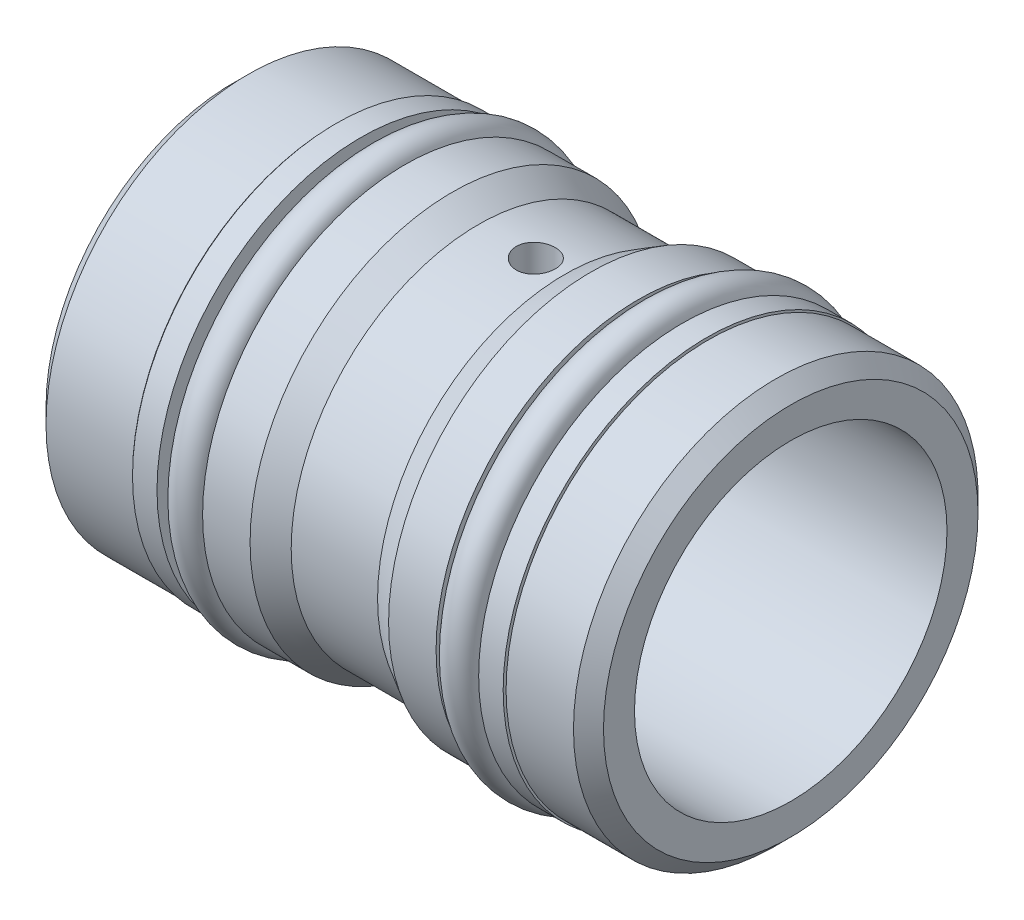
ISO-10303-21;
HEADER;
FILE_DESCRIPTION(('STEP AP214'),'2;1');
FILE_NAME('part.step','',(''),(''),'','','');
FILE_SCHEMA(('AUTOMOTIVE_DESIGN { 1 0 10303 214 1 1 1 1 }'));
ENDSEC;
DATA;
#1=APPLICATION_CONTEXT('core data for automotive mechanical design processes');
#2=APPLICATION_PROTOCOL_DEFINITION('international standard','automotive_design',2000,#1);
#3=PRODUCT_CONTEXT('',#1,'mechanical');
#4=PRODUCT('Part','Part','',(#3));
#5=PRODUCT_RELATED_PRODUCT_CATEGORY('part','',(#4));
#6=PRODUCT_DEFINITION_FORMATION('','',#4);
#7=PRODUCT_DEFINITION_CONTEXT('part definition',#1,'design');
#8=PRODUCT_DEFINITION('design','',#6,#7);
#9=PRODUCT_DEFINITION_SHAPE('','',#8);
#10=(LENGTH_UNIT() NAMED_UNIT(*) SI_UNIT(.MILLI.,.METRE.));
#11=(NAMED_UNIT(*) PLANE_ANGLE_UNIT() SI_UNIT($,.RADIAN.));
#12=(NAMED_UNIT(*) SI_UNIT($,.STERADIAN.) SOLID_ANGLE_UNIT());
#13=UNCERTAINTY_MEASURE_WITH_UNIT(LENGTH_MEASURE(1.E-05),#10,'distance_accuracy_value','');
#14=(GEOMETRIC_REPRESENTATION_CONTEXT(3) GLOBAL_UNCERTAINTY_ASSIGNED_CONTEXT((#13)) GLOBAL_UNIT_ASSIGNED_CONTEXT((#10,
#11,#12)) REPRESENTATION_CONTEXT('',''));
#15=CARTESIAN_POINT('',(0.,0.,0.));
#16=DIRECTION('',(0.,0.,1.));
#17=DIRECTION('',(1.,0.,0.));
#18=AXIS2_PLACEMENT_3D('',#15,#16,#17);
#19=CARTESIAN_POINT('',(0.,0.,0.));
#20=DIRECTION('',(-1.,0.,0.));
#21=DIRECTION('',(0.,0.,1.));
#22=AXIS2_PLACEMENT_3D('',#19,#20,#21);
#23=CYLINDRICAL_SURFACE('',#22,9.51);
#24=CARTESIAN_POINT('',(-1.70719356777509,0.,0.));
#25=DIRECTION('',(-1.,0.,0.));
#26=DIRECTION('',(0.,0.,1.));
#27=AXIS2_PLACEMENT_3D('',#24,#25,#26);
#28=CIRCLE('',#27,9.51);
#29=CARTESIAN_POINT('',(-1.70719356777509,0.,9.51));
#30=VERTEX_POINT('',#29);
#31=EDGE_CURVE('E37',#30,#30,#28,.T.);
#32=ORIENTED_EDGE('',*,*,#31,.F.);
#33=EDGE_LOOP('',(#32));
#34=FACE_BOUND('',#33,.T.);
#35=CARTESIAN_POINT('',(1.21,-9.45826684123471,0.9906));
#36=CARTESIAN_POINT('',(1.26548025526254,-9.45826751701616,0.990597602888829));
#37=CARTESIAN_POINT('',(1.32099689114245,-9.45876025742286,0.985923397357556));
#38=CARTESIAN_POINT('',(1.43049006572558,-9.46067763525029,0.967348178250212));
#39=CARTESIAN_POINT('',(1.48446485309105,-9.46210329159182,0.953437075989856));
#40=CARTESIAN_POINT('',(1.58927290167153,-9.46572330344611,0.916798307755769));
#41=CARTESIAN_POINT('',(1.64010807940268,-9.46791718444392,0.894076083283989));
#42=CARTESIAN_POINT('',(1.73723242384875,-9.47282586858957,0.840470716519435));
#43=CARTESIAN_POINT('',(1.78352247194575,-9.4755405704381,0.809589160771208));
#44=CARTESIAN_POINT('',(1.8704353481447,-9.48119697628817,0.740411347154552));
#45=CARTESIAN_POINT('',(1.91103777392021,-9.48413944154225,0.702089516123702));
#46=CARTESIAN_POINT('',(1.98524707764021,-9.48991293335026,0.619173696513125));
#47=CARTESIAN_POINT('',(2.01885363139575,-9.49274395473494,0.574579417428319));
#48=CARTESIAN_POINT('',(2.07818821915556,-9.49798314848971,0.480258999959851));
#49=CARTESIAN_POINT('',(2.10389812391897,-9.50039034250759,0.430521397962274));
#50=CARTESIAN_POINT('',(2.14659360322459,-9.50450235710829,0.327405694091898));
#51=CARTESIAN_POINT('',(2.16357940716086,-9.5062071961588,0.274027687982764));
#52=CARTESIAN_POINT('',(2.18828448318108,-9.50871706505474,0.165353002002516));
#53=CARTESIAN_POINT('',(2.19603734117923,-9.50952535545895,0.110064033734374));
#54=CARTESIAN_POINT('',(2.20216039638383,-9.51016215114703,-0.0010358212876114));
#55=CARTESIAN_POINT('',(2.20053085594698,-9.50999068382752,-0.0568466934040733));
#56=CARTESIAN_POINT('',(2.18796258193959,-9.50868994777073,-0.167178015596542));
#57=CARTESIAN_POINT('',(2.17705996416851,-9.50756439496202,-0.221702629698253));
#58=CARTESIAN_POINT('',(2.14631131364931,-9.5044862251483,-0.328143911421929));
#59=CARTESIAN_POINT('',(2.12646515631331,-9.50253359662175,-0.380060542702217));
#60=CARTESIAN_POINT('',(2.07835336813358,-9.49801438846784,-0.479925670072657));
#61=CARTESIAN_POINT('',(2.05007180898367,-9.49544664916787,-0.527866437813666));
#62=CARTESIAN_POINT('',(1.98590359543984,-9.48998521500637,-0.618334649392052));
#63=CARTESIAN_POINT('',(1.95001669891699,-9.48709150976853,-0.660861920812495));
#64=CARTESIAN_POINT('',(1.87145351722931,-9.48128652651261,-0.739507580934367));
#65=CARTESIAN_POINT('',(1.82874580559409,-9.47837523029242,-0.775594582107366));
#66=CARTESIAN_POINT('',(1.73786211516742,-9.4728768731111,-0.840092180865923));
#67=CARTESIAN_POINT('',(1.68968612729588,-9.47028981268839,-0.868502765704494));
#68=CARTESIAN_POINT('',(1.58920872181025,-9.4657326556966,-0.916841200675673));
#69=CARTESIAN_POINT('',(1.53690632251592,-9.46376270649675,-0.936767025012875));
#70=CARTESIAN_POINT('',(1.42967308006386,-9.46066583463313,-0.967545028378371));
#71=CARTESIAN_POINT('',(1.37474232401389,-9.45953888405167,-0.9783975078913));
#72=CARTESIAN_POINT('',(1.264087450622,-9.4582604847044,-0.990680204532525));
#73=CARTESIAN_POINT('',(1.20836826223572,-9.45810448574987,-0.992154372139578));
#74=CARTESIAN_POINT('',(1.0974761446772,-9.45877364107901,-0.985754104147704));
#75=CARTESIAN_POINT('',(1.04230320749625,-9.45959878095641,-0.977879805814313));
#76=CARTESIAN_POINT('',(0.934198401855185,-9.46213310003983,-0.953042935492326));
#77=CARTESIAN_POINT('',(0.881261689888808,-9.46384025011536,-0.936101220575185));
#78=CARTESIAN_POINT('',(0.778981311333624,-9.46794459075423,-0.893631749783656));
#79=CARTESIAN_POINT('',(0.729637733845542,-9.47034179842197,-0.868103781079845));
#80=CARTESIAN_POINT('',(0.635744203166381,-9.47556714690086,-0.809076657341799));
#81=CARTESIAN_POINT('',(0.591212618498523,-9.47839684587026,-0.775548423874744));
#82=CARTESIAN_POINT('',(0.508393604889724,-9.48416327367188,-0.701514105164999));
#83=CARTESIAN_POINT('',(0.470106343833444,-9.4871000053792,-0.661007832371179));
#84=CARTESIAN_POINT('',(0.400710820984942,-9.49276337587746,-0.573976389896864));
#85=CARTESIAN_POINT('',(0.36963126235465,-9.49548914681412,-0.527428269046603));
#86=CARTESIAN_POINT('',(0.31573105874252,-9.5004107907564,-0.429747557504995));
#87=CARTESIAN_POINT('',(0.292910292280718,-9.50260667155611,-0.3786150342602));
#88=CARTESIAN_POINT('',(0.256223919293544,-9.50621721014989,-0.273316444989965));
#89=CARTESIAN_POINT('',(0.242341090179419,-9.50763336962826,-0.219156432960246));
#90=CARTESIAN_POINT('',(0.223868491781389,-9.50953107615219,-0.109258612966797));
#91=CARTESIAN_POINT('',(0.219278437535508,-9.51001265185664,-0.0535208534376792));
#92=CARTESIAN_POINT('',(0.21952588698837,-9.50998689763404,0.0576685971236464));
#93=CARTESIAN_POINT('',(0.224318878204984,-9.5094842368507,0.113120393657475));
#94=CARTESIAN_POINT('',(0.243102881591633,-9.50755571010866,0.222426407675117));
#95=CARTESIAN_POINT('',(0.257093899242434,-9.50612984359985,0.276280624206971));
#96=CARTESIAN_POINT('',(0.293864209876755,-9.50251461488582,0.380861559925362));
#97=CARTESIAN_POINT('',(0.316642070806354,-9.50032537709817,0.431588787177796));
#98=CARTESIAN_POINT('',(0.370334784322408,-9.49542719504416,0.528507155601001));
#99=CARTESIAN_POINT('',(0.401249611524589,-9.49271825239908,0.574698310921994));
#100=CARTESIAN_POINT('',(0.470505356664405,-9.48706860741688,0.661461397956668));
#101=CARTESIAN_POINT('',(0.508879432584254,-9.48412690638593,0.702006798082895));
#102=CARTESIAN_POINT('',(0.591898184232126,-9.47835168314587,0.776102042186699));
#103=CARTESIAN_POINT('',(0.636544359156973,-9.47551818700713,0.809650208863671));
#104=CARTESIAN_POINT('',(0.730974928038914,-9.47027190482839,0.868872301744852));
#105=CARTESIAN_POINT('',(0.780773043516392,-9.46786029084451,0.894524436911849));
#106=CARTESIAN_POINT('',(0.883963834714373,-9.46374473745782,0.937068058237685));
#107=CARTESIAN_POINT('',(0.937352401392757,-9.46204000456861,0.953969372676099));
#108=CARTESIAN_POINT('',(1.0275329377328,-9.4599587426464,0.974342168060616));
#109=CARTESIAN_POINT('',(1.06374943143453,-9.45932730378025,0.98043045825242));
#110=CARTESIAN_POINT('',(1.13663864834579,-9.45848113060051,0.988560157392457));
#111=CARTESIAN_POINT('',(1.17331136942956,-9.45826639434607,0.990601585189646));
#112=CARTESIAN_POINT('',(1.21,-9.45826684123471,0.9906));
#113=B_SPLINE_CURVE_WITH_KNOTS('',3,(#35,#36,#37,#38,#39,#40,#41,#42,#43,#44,#45,#46,#47,#48,
#49,#50,#51,#52,#53,#54,#55,#56,#57,#58,#59,#60,#61,#62,#63,#64,#65,#66,#67,#68,#69,#70,#71,#72,
#73,#74,#75,#76,#77,#78,#79,#80,#81,#82,#83,#84,#85,#86,#87,#88,#89,#90,#91,#92,#93,#94,#95,#96,
#97,#98,#99,#100,#101,#102,#103,#104,#105,#106,#107,#108,#109,#110,#111,#112),.UNSPECIFIED.,.T.,
.F.,(4,2,2,2,2,2,2,2,2,2,2,2,2,2,2,2,2,2,2,2,2,2,2,2,2,2,2,2,2,2,2,2,2,2,2,2,2,2,4),(0.,
0.166306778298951,0.332795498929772,0.499181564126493,0.665535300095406,0.832471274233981,
0.999414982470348,1.16673914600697,1.33405890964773,1.50076815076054,1.66747273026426,
1.83353100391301,1.99959159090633,2.16596775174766,2.33234921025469,2.4995206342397,
2.66669233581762,2.83390392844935,3.00110998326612,3.16753186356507,3.33395130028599,
3.49998957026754,3.66603195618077,3.83268730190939,3.9993471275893,4.16665966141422,
4.33396973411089,4.50095644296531,4.66793803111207,4.8341293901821,5.00032084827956,
5.16648523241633,5.33264909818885,5.49956922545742,5.66652931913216,5.83394613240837,
6.00117450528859,6.11115230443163,6.22112959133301),.UNSPECIFIED.);
#114=CARTESIAN_POINT('',(1.21,-9.45826684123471,0.9906));
#115=VERTEX_POINT('',#114);
#116=EDGE_CURVE('E48',#115,#115,#113,.T.);
#117=ORIENTED_EDGE('',*,*,#116,.T.);
#118=EDGE_LOOP('',(#117));
#119=FACE_BOUND('',#118,.T.);
#120=CARTESIAN_POINT('',(1.21,9.45826684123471,0.9906));
#121=CARTESIAN_POINT('',(1.15451974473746,9.45826751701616,0.990597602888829));
#122=CARTESIAN_POINT('',(1.09900310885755,9.45876025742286,0.985923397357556));
#123=CARTESIAN_POINT('',(0.98950993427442,9.46067763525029,0.967348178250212));
#124=CARTESIAN_POINT('',(0.935535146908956,9.46210329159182,0.953437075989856));
#125=CARTESIAN_POINT('',(0.830727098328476,9.46572330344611,0.916798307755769));
#126=CARTESIAN_POINT('',(0.779891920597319,9.46791718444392,0.894076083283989));
#127=CARTESIAN_POINT('',(0.682767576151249,9.47282586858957,0.840470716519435));
#128=CARTESIAN_POINT('',(0.636477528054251,9.4755405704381,0.809589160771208));
#129=CARTESIAN_POINT('',(0.549564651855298,9.48119697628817,0.740411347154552));
#130=CARTESIAN_POINT('',(0.508962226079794,9.48413944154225,0.702089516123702));
#131=CARTESIAN_POINT('',(0.43475292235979,9.48991293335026,0.619173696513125));
#132=CARTESIAN_POINT('',(0.40114636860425,9.49274395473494,0.574579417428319));
#133=CARTESIAN_POINT('',(0.341811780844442,9.49798314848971,0.480258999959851));
#134=CARTESIAN_POINT('',(0.316101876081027,9.50039034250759,0.430521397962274));
#135=CARTESIAN_POINT('',(0.27340639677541,9.50450235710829,0.327405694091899));
#136=CARTESIAN_POINT('',(0.256420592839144,9.5062071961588,0.274027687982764));
#137=CARTESIAN_POINT('',(0.231715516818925,9.50871706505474,0.165353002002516));
#138=CARTESIAN_POINT('',(0.223962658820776,9.50952535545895,0.110064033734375));
#139=CARTESIAN_POINT('',(0.217839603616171,9.51016215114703,-0.00103582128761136));
#140=CARTESIAN_POINT('',(0.219469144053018,9.50999068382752,-0.0568466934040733));
#141=CARTESIAN_POINT('',(0.232037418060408,9.50868994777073,-0.167178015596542));
#142=CARTESIAN_POINT('',(0.242940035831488,9.50756439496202,-0.221702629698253));
#143=CARTESIAN_POINT('',(0.273688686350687,9.5044862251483,-0.328143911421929));
#144=CARTESIAN_POINT('',(0.293534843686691,9.50253359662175,-0.380060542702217));
#145=CARTESIAN_POINT('',(0.341646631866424,9.49801438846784,-0.479925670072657));
#146=CARTESIAN_POINT('',(0.369928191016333,9.49544664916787,-0.527866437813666));
#147=CARTESIAN_POINT('',(0.434096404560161,9.48998521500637,-0.618334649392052));
#148=CARTESIAN_POINT('',(0.469983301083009,9.48709150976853,-0.660861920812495));
#149=CARTESIAN_POINT('',(0.548546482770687,9.48128652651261,-0.739507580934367));
#150=CARTESIAN_POINT('',(0.591254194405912,9.47837523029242,-0.775594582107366));
#151=CARTESIAN_POINT('',(0.682137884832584,9.4728768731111,-0.840092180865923));
#152=CARTESIAN_POINT('',(0.730313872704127,9.47028981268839,-0.868502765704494));
#153=CARTESIAN_POINT('',(0.830791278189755,9.4657326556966,-0.916841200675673));
#154=CARTESIAN_POINT('',(0.883093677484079,9.46376270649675,-0.936767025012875));
#155=CARTESIAN_POINT('',(0.990326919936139,9.46066583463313,-0.967545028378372));
#156=CARTESIAN_POINT('',(1.04525767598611,9.45953888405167,-0.9783975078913));
#157=CARTESIAN_POINT('',(1.155912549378,9.4582604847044,-0.990680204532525));
#158=CARTESIAN_POINT('',(1.21163173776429,9.45810448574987,-0.992154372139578));
#159=CARTESIAN_POINT('',(1.3225238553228,9.45877364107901,-0.985754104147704));
#160=CARTESIAN_POINT('',(1.37769679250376,9.45959878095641,-0.977879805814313));
#161=CARTESIAN_POINT('',(1.48580159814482,9.46213310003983,-0.953042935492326));
#162=CARTESIAN_POINT('',(1.53873831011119,9.46384025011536,-0.936101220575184));
#163=CARTESIAN_POINT('',(1.64101868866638,9.46794459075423,-0.893631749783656));
#164=CARTESIAN_POINT('',(1.69036226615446,9.47034179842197,-0.868103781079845));
#165=CARTESIAN_POINT('',(1.78425579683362,9.47556714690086,-0.809076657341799));
#166=CARTESIAN_POINT('',(1.82878738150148,9.47839684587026,-0.775548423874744));
#167=CARTESIAN_POINT('',(1.91160639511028,9.48416327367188,-0.701514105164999));
#168=CARTESIAN_POINT('',(1.94989365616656,9.4871000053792,-0.661007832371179));
#169=CARTESIAN_POINT('',(2.01928917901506,9.49276337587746,-0.573976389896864));
#170=CARTESIAN_POINT('',(2.05036873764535,9.49548914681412,-0.527428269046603));
#171=CARTESIAN_POINT('',(2.10426894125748,9.5004107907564,-0.429747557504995));
#172=CARTESIAN_POINT('',(2.12708970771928,9.50260667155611,-0.378615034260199));
#173=CARTESIAN_POINT('',(2.16377608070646,9.50621721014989,-0.273316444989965));
#174=CARTESIAN_POINT('',(2.17765890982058,9.50763336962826,-0.219156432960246));
#175=CARTESIAN_POINT('',(2.19613150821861,9.50953107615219,-0.109258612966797));
#176=CARTESIAN_POINT('',(2.20072156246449,9.51001265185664,-0.0535208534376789));
#177=CARTESIAN_POINT('',(2.20047411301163,9.50998689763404,0.0576685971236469));
#178=CARTESIAN_POINT('',(2.19568112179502,9.5094842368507,0.113120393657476));
#179=CARTESIAN_POINT('',(2.17689711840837,9.50755571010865,0.222426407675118));
#180=CARTESIAN_POINT('',(2.16290610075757,9.50612984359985,0.276280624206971));
#181=CARTESIAN_POINT('',(2.12613579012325,9.50251461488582,0.380861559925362));
#182=CARTESIAN_POINT('',(2.10335792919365,9.50032537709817,0.431588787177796));
#183=CARTESIAN_POINT('',(2.04966521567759,9.49542719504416,0.528507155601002));
#184=CARTESIAN_POINT('',(2.01875038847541,9.49271825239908,0.574698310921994));
#185=CARTESIAN_POINT('',(1.9494946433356,9.48706860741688,0.661461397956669));
#186=CARTESIAN_POINT('',(1.91112056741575,9.48412690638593,0.702006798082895));
#187=CARTESIAN_POINT('',(1.82810181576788,9.47835168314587,0.776102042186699));
#188=CARTESIAN_POINT('',(1.78345564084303,9.47551818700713,0.809650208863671));
#189=CARTESIAN_POINT('',(1.68902507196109,9.4702719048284,0.868872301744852));
#190=CARTESIAN_POINT('',(1.63922695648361,9.46786029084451,0.894524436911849));
#191=CARTESIAN_POINT('',(1.53603616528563,9.46374473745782,0.937068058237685));
#192=CARTESIAN_POINT('',(1.48264759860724,9.46204000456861,0.9539693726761));
#193=CARTESIAN_POINT('',(1.3924670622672,9.4599587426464,0.974342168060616));
#194=CARTESIAN_POINT('',(1.35625056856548,9.45932730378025,0.98043045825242));
#195=CARTESIAN_POINT('',(1.28336135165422,9.45848113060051,0.988560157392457));
#196=CARTESIAN_POINT('',(1.24668863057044,9.45826639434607,0.990601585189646));
#197=CARTESIAN_POINT('',(1.21,9.45826684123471,0.9906));
#198=B_SPLINE_CURVE_WITH_KNOTS('',3,(#120,#121,#122,#123,#124,#125,#126,#127,#128,#129,#130,
#131,#132,#133,#134,#135,#136,#137,#138,#139,#140,#141,#142,#143,#144,#145,#146,#147,#148,#149,
#150,#151,#152,#153,#154,#155,#156,#157,#158,#159,#160,#161,#162,#163,#164,#165,#166,#167,#168,
#169,#170,#171,#172,#173,#174,#175,#176,#177,#178,#179,#180,#181,#182,#183,#184,#185,#186,#187,
#188,#189,#190,#191,#192,#193,#194,#195,#196,#197),.UNSPECIFIED.,.T.,.F.,(4,2,2,2,2,2,2,2,2,2,2,
2,2,2,2,2,2,2,2,2,2,2,2,2,2,2,2,2,2,2,2,2,2,2,2,2,2,2,4),(0.,0.166306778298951,
0.332795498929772,0.499181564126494,0.665535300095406,0.832471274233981,0.999414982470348,
1.16673914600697,1.33405890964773,1.50076815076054,1.66747273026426,1.83353100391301,
1.99959159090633,2.16596775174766,2.33234921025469,2.49952063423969,2.66669233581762,
2.83390392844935,3.00110998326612,3.16753186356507,3.33395130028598,3.49998957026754,
3.66603195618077,3.83268730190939,3.9993471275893,4.16665966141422,4.33396973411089,
4.50095644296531,4.66793803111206,4.8341293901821,5.00032084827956,5.16648523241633,
5.33264909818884,5.49956922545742,5.66652931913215,5.83394613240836,6.00117450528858,
6.11115230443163,6.221129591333),.UNSPECIFIED.);
#199=CARTESIAN_POINT('',(1.21,9.45826684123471,0.9906));
#200=VERTEX_POINT('',#199);
#201=EDGE_CURVE('E56',#200,#200,#198,.T.);
#202=ORIENTED_EDGE('',*,*,#201,.T.);
#203=EDGE_LOOP('',(#202));
#204=FACE_BOUND('',#203,.T.);
#205=CARTESIAN_POINT('',(2.68099356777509,0.,0.));
#206=DIRECTION('',(1.,0.,0.));
#207=DIRECTION('',(0.,0.,-1.));
#208=AXIS2_PLACEMENT_3D('',#205,#206,#207);
#209=CIRCLE('',#208,9.51);
#210=CARTESIAN_POINT('',(2.68099356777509,0.,-9.51));
#211=VERTEX_POINT('',#210);
#212=EDGE_CURVE('E10',#211,#211,#209,.T.);
#213=ORIENTED_EDGE('',*,*,#212,.F.);
#214=EDGE_LOOP('',(#213));
#215=FACE_BOUND('',#214,.T.);
#216=ADVANCED_FACE('F30',(#34,#119,#204,#215),#23,.T.);
#217=CARTESIAN_POINT('',(0.,0.,0.));
#218=DIRECTION('',(-1.,0.,0.));
#219=DIRECTION('',(0.,0.,1.));
#220=AXIS2_PLACEMENT_3D('',#217,#218,#219);
#221=CYLINDRICAL_SURFACE('',#220,9.0043);
#222=CARTESIAN_POINT('',(7.74310715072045,0.,0.));
#223=DIRECTION('',(-1.,0.,0.));
#224=DIRECTION('',(0.,0.,1.));
#225=AXIS2_PLACEMENT_3D('',#222,#223,#224);
#226=CIRCLE('',#225,9.0043);
#227=CARTESIAN_POINT('',(7.74310715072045,0.,9.0043));
#228=VERTEX_POINT('',#227);
#229=EDGE_CURVE('E206',#228,#228,#226,.T.);
#230=ORIENTED_EDGE('',*,*,#229,.F.);
#231=EDGE_LOOP('',(#230));
#232=FACE_BOUND('',#231,.T.);
#233=CARTESIAN_POINT('',(8.6568,0.,0.));
#234=DIRECTION('',(1.,0.,0.));
#235=DIRECTION('',(0.,0.,-1.));
#236=AXIS2_PLACEMENT_3D('',#233,#234,#235);
#237=CIRCLE('',#236,9.0043);
#238=CARTESIAN_POINT('',(8.6568,0.,-9.0043));
#239=VERTEX_POINT('',#238);
#240=EDGE_CURVE('E41',#239,#239,#237,.T.);
#241=ORIENTED_EDGE('',*,*,#240,.F.);
#242=EDGE_LOOP('',(#241));
#243=FACE_BOUND('',#242,.T.);
#244=ADVANCED_FACE('F121',(#232,#243),#221,.T.);
#245=CARTESIAN_POINT('',(9.9738,0.,0.));
#246=DIRECTION('',(-1.,0.,0.));
#247=DIRECTION('',(0.,0.,1.));
#248=AXIS2_PLACEMENT_3D('',#245,#246,#247);
#249=CIRCLE('',#248,9.0043);
#250=CARTESIAN_POINT('',(9.9738,0.,9.0043));
#251=VERTEX_POINT('',#250);
#252=EDGE_CURVE('E167',#251,#251,#249,.T.);
#253=ORIENTED_EDGE('',*,*,#252,.T.);
#254=EDGE_LOOP('',(#253));
#255=FACE_BOUND('',#254,.T.);
#256=CARTESIAN_POINT('',(9.9014,0.,0.));
#257=DIRECTION('',(-1.,0.,0.));
#258=DIRECTION('',(0.,0.,1.));
#259=AXIS2_PLACEMENT_3D('',#256,#257,#258);
#260=CIRCLE('',#259,9.0043);
#261=CARTESIAN_POINT('',(9.9014,0.,9.0043));
#262=VERTEX_POINT('',#261);
#263=EDGE_CURVE('E45',#262,#262,#260,.T.);
#264=ORIENTED_EDGE('',*,*,#263,.F.);
#265=EDGE_LOOP('',(#264));
#266=FACE_BOUND('',#265,.T.);
#267=ADVANCED_FACE('F126',(#255,#266),#221,.T.);
#268=CARTESIAN_POINT('',(6.4178,0.,0.));
#269=DIRECTION('',(-1.,0.,0.));
#270=DIRECTION('',(0.,0.,1.));
#271=AXIS2_PLACEMENT_3D('',#268,#269,#270);
#272=CIRCLE('',#271,9.0043);
#273=CARTESIAN_POINT('',(6.4178,0.,9.0043));
#274=VERTEX_POINT('',#273);
#275=EDGE_CURVE('E158',#274,#274,#272,.T.);
#276=ORIENTED_EDGE('',*,*,#275,.F.);
#277=EDGE_LOOP('',(#276));
#278=FACE_BOUND('',#277,.T.);
#279=CARTESIAN_POINT('',(7.02289284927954,0.,0.));
#280=DIRECTION('',(1.,0.,0.));
#281=DIRECTION('',(0.,0.,-1.));
#282=AXIS2_PLACEMENT_3D('',#279,#280,#281);
#283=CIRCLE('',#282,9.0043);
#284=CARTESIAN_POINT('',(7.02289284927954,0.,-9.0043));
#285=VERTEX_POINT('',#284);
#286=EDGE_CURVE('E209',#285,#285,#283,.T.);
#287=ORIENTED_EDGE('',*,*,#286,.F.);
#288=EDGE_LOOP('',(#287));
#289=FACE_BOUND('',#288,.T.);
#290=ADVANCED_FACE('F129',(#278,#289),#221,.T.);
#291=CARTESIAN_POINT('',(0.,0.,0.));
#292=DIRECTION('',(-1.,0.,0.));
#293=DIRECTION('',(0.,0.,1.));
#294=AXIS2_PLACEMENT_3D('',#291,#292,#293);
#295=CYLINDRICAL_SURFACE('',#294,9.0043);
#296=CARTESIAN_POINT('',(-7.683,0.,0.));
#297=DIRECTION('',(-1.,0.,0.));
#298=DIRECTION('',(0.,0.,1.));
#299=AXIS2_PLACEMENT_3D('',#296,#297,#298);
#300=CIRCLE('',#299,9.0043);
#301=CARTESIAN_POINT('',(-7.683,0.,9.0043));
#302=VERTEX_POINT('',#301);
#303=EDGE_CURVE('E194',#302,#302,#300,.T.);
#304=ORIENTED_EDGE('',*,*,#303,.F.);
#305=EDGE_LOOP('',(#304));
#306=FACE_BOUND('',#305,.T.);
#307=CARTESIAN_POINT('',(-6.76930715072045,0.,0.));
#308=DIRECTION('',(1.,0.,0.));
#309=DIRECTION('',(0.,0.,-1.));
#310=AXIS2_PLACEMENT_3D('',#307,#308,#309);
#311=CIRCLE('',#310,9.0043);
#312=CARTESIAN_POINT('',(-6.76930715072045,0.,-9.0043));
#313=VERTEX_POINT('',#312);
#314=EDGE_CURVE('E203',#313,#313,#311,.T.);
#315=ORIENTED_EDGE('',*,*,#314,.F.);
#316=EDGE_LOOP('',(#315));
#317=FACE_BOUND('',#316,.T.);
#318=ADVANCED_FACE('F221',(#306,#317),#295,.T.);
#319=CARTESIAN_POINT('',(-5.444,0.,0.));
#320=DIRECTION('',(-1.,0.,0.));
#321=DIRECTION('',(0.,0.,1.));
#322=AXIS2_PLACEMENT_3D('',#319,#320,#321);
#323=CIRCLE('',#322,9.0043);
#324=CARTESIAN_POINT('',(-5.444,0.,9.0043));
#325=VERTEX_POINT('',#324);
#326=EDGE_CURVE('E161',#325,#325,#323,.T.);
#327=ORIENTED_EDGE('',*,*,#326,.T.);
#328=EDGE_LOOP('',(#327));
#329=FACE_BOUND('',#328,.T.);
#330=CARTESIAN_POINT('',(-6.04909284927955,0.,0.));
#331=DIRECTION('',(-1.,0.,0.));
#332=DIRECTION('',(0.,0.,1.));
#333=AXIS2_PLACEMENT_3D('',#330,#331,#332);
#334=CIRCLE('',#333,9.0043);
#335=CARTESIAN_POINT('',(-6.04909284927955,0.,9.0043));
#336=VERTEX_POINT('',#335);
#337=EDGE_CURVE('E200',#336,#336,#334,.T.);
#338=ORIENTED_EDGE('',*,*,#337,.F.);
#339=EDGE_LOOP('',(#338));
#340=FACE_BOUND('',#339,.T.);
#341=ADVANCED_FACE('F269',(#329,#340),#295,.T.);
#342=CARTESIAN_POINT('',(-9.,0.,0.));
#343=DIRECTION('',(-1.,0.,0.));
#344=DIRECTION('',(0.,0.,1.));
#345=AXIS2_PLACEMENT_3D('',#342,#343,#344);
#346=CIRCLE('',#345,9.0043);
#347=CARTESIAN_POINT('',(-9.,0.,9.0043));
#348=VERTEX_POINT('',#347);
#349=EDGE_CURVE('E258',#348,#348,#346,.T.);
#350=ORIENTED_EDGE('',*,*,#349,.F.);
#351=EDGE_LOOP('',(#350));
#352=FACE_BOUND('',#351,.T.);
#353=CARTESIAN_POINT('',(-8.9276,0.,0.));
#354=DIRECTION('',(1.,0.,0.));
#355=DIRECTION('',(0.,0.,-1.));
#356=AXIS2_PLACEMENT_3D('',#353,#354,#355);
#357=CIRCLE('',#356,9.0043);
#358=CARTESIAN_POINT('',(-8.9276,0.,-9.0043));
#359=VERTEX_POINT('',#358);
#360=EDGE_CURVE('E197',#359,#359,#357,.T.);
#361=ORIENTED_EDGE('',*,*,#360,.F.);
#362=EDGE_LOOP('',(#361));
#363=FACE_BOUND('',#362,.T.);
#364=ADVANCED_FACE('F103',(#352,#363),#295,.T.);
#365=CARTESIAN_POINT('',(0.,0.,0.));
#366=DIRECTION('',(-1.,0.,0.));
#367=DIRECTION('',(0.,0.,1.));
#368=AXIS2_PLACEMENT_3D('',#365,#366,#367);
#369=CYLINDRICAL_SURFACE('',#368,4.7625);
#370=CARTESIAN_POINT('',(0.0884000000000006,0.,0.));
#371=DIRECTION('',(-1.,0.,0.));
#372=DIRECTION('',(0.,0.,1.));
#373=AXIS2_PLACEMENT_3D('',#370,#371,#372);
#374=CIRCLE('',#373,4.7625);
#375=CARTESIAN_POINT('',(0.0884000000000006,0.,4.7625));
#376=VERTEX_POINT('',#375);
#377=EDGE_CURVE('E179',#376,#376,#374,.T.);
#378=ORIENTED_EDGE('',*,*,#377,.F.);
#379=EDGE_LOOP('',(#378));
#380=FACE_BOUND('',#379,.T.);
#381=CARTESIAN_POINT('',(-14.16,0.,0.));
#382=DIRECTION('',(-1.,0.,0.));
#383=DIRECTION('',(0.,0.,1.));
#384=AXIS2_PLACEMENT_3D('',#381,#382,#383);
#385=CIRCLE('',#384,4.7625);
#386=CARTESIAN_POINT('',(-14.16,0.,4.7625));
#387=VERTEX_POINT('',#386);
#388=EDGE_CURVE('E252',#387,#387,#385,.T.);
#389=ORIENTED_EDGE('',*,*,#388,.T.);
#390=EDGE_LOOP('',(#389));
#391=FACE_BOUND('',#390,.T.);
#392=ADVANCED_FACE('F100',(#380,#391),#369,.F.);
#393=CARTESIAN_POINT('',(0.0884000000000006,4.7625,0.));
#394=DIRECTION('',(-1.,0.,0.));
#395=DIRECTION('',(0.,0.,1.));
#396=AXIS2_PLACEMENT_3D('',#393,#394,#395);
#397=PLANE('',#396);
#398=CARTESIAN_POINT('',(0.0884000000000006,0.,0.));
#399=DIRECTION('',(-1.,0.,0.));
#400=DIRECTION('',(0.,0.,1.));
#401=AXIS2_PLACEMENT_3D('',#398,#399,#400);
#402=CIRCLE('',#401,7.9375);
#403=CARTESIAN_POINT('',(0.0884000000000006,0.,7.9375));
#404=VERTEX_POINT('',#403);
#405=EDGE_CURVE('E176',#404,#404,#402,.T.);
#406=ORIENTED_EDGE('',*,*,#405,.F.);
#407=EDGE_LOOP('',(#406));
#408=FACE_BOUND('',#407,.T.);
#409=ORIENTED_EDGE('',*,*,#377,.T.);
#410=EDGE_LOOP('',(#409));
#411=FACE_BOUND('',#410,.T.);
#412=ADVANCED_FACE('F94',(#408,#411),#397,.F.);
#413=CARTESIAN_POINT('',(0.,0.,0.));
#414=DIRECTION('',(-1.,0.,0.));
#415=DIRECTION('',(0.,0.,1.));
#416=AXIS2_PLACEMENT_3D('',#413,#414,#415);
#417=CYLINDRICAL_SURFACE('',#416,7.9375);
#418=CARTESIAN_POINT('',(1.21,-7.8754439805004,0.9906));
#419=CARTESIAN_POINT('',(1.15459052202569,-7.87544477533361,0.990597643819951));
#420=CARTESIAN_POINT('',(1.09914639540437,-7.87603506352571,0.985935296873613));
#421=CARTESIAN_POINT('',(0.989801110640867,-7.87833154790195,0.967409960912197));
#422=CARTESIAN_POINT('',(0.935901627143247,-7.88003891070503,0.953537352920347));
#423=CARTESIAN_POINT('',(0.831244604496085,-7.88437321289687,0.917006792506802));
#424=CARTESIAN_POINT('',(0.780484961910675,-7.88699952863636,0.894354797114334));
#425=CARTESIAN_POINT('',(0.683496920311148,-7.892875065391,0.840921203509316));
#426=CARTESIAN_POINT('',(0.637267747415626,-7.89612417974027,0.810140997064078));
#427=CARTESIAN_POINT('',(0.550385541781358,-7.9028995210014,0.741140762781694));
#428=CARTESIAN_POINT('',(0.509761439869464,-7.90642704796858,0.702884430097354));
#429=CARTESIAN_POINT('',(0.435492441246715,-7.9133500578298,0.620096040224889));
#430=CARTESIAN_POINT('',(0.401847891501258,-7.91674553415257,0.575563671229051));
#431=CARTESIAN_POINT('',(0.342389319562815,-7.92303516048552,0.481305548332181));
#432=CARTESIAN_POINT('',(0.316601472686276,-7.92592762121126,0.431563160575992));
#433=CARTESIAN_POINT('',(0.273755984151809,-7.93087102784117,0.32841157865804));
#434=CARTESIAN_POINT('',(0.256698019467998,-7.93292200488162,0.275002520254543));
#435=CARTESIAN_POINT('',(0.231882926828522,-7.93594219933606,0.166329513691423));
#436=CARTESIAN_POINT('',(0.224077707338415,-7.93691700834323,0.111076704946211));
#437=CARTESIAN_POINT('',(0.21784062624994,-7.93769412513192,3.74751752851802E-05));
#438=CARTESIAN_POINT('',(0.219408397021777,-7.93749647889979,-0.0557489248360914));
#439=CARTESIAN_POINT('',(0.231834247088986,-7.93595547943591,-0.165944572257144));
#440=CARTESIAN_POINT('',(0.24264060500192,-7.9346185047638,-0.22035975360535));
#441=CARTESIAN_POINT('',(0.273156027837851,-7.93095624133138,-0.326598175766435));
#442=CARTESIAN_POINT('',(0.292865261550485,-7.92863093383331,-0.378421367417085));
#443=CARTESIAN_POINT('',(0.340681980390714,-7.9232423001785,-0.478164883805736));
#444=CARTESIAN_POINT('',(0.368811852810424,-7.9201770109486,-0.526074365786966));
#445=CARTESIAN_POINT('',(0.432655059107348,-7.9136513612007,-0.616512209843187));
#446=CARTESIAN_POINT('',(0.468368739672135,-7.91019098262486,-0.659040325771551));
#447=CARTESIAN_POINT('',(0.54665547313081,-7.9032345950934,-0.737812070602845));
#448=CARTESIAN_POINT('',(0.58927360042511,-7.89973850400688,-0.77401091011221));
#449=CARTESIAN_POINT('',(0.680004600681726,-7.89312799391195,-0.838748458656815));
#450=CARTESIAN_POINT('',(0.728117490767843,-7.89001357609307,-0.867287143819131));
#451=CARTESIAN_POINT('',(0.828512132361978,-7.88451906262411,-0.915896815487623));
#452=CARTESIAN_POINT('',(0.880795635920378,-7.88213927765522,-0.935964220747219));
#453=CARTESIAN_POINT('',(0.988026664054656,-7.87838953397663,-0.96702200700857));
#454=CARTESIAN_POINT('',(1.04297406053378,-7.87701952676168,-0.97801282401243));
#455=CARTESIAN_POINT('',(1.15357756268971,-7.87545331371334,-0.990546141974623));
#456=CARTESIAN_POINT('',(1.20922641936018,-7.87524927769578,-0.992151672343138));
#457=CARTESIAN_POINT('',(1.3199998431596,-7.8760173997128,-0.986035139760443));
#458=CARTESIAN_POINT('',(1.37512442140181,-7.8769895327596,-0.978313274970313));
#459=CARTESIAN_POINT('',(1.48309566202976,-7.87999331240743,-0.953814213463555));
#460=CARTESIAN_POINT('',(1.53594935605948,-7.88202138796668,-0.937067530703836));
#461=CARTESIAN_POINT('',(1.63809847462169,-7.88690564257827,-0.895025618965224));
#462=CARTESIAN_POINT('',(1.68739377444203,-7.88976185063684,-0.869730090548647));
#463=CARTESIAN_POINT('',(1.78131197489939,-7.89599930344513,-0.811153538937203));
#464=CARTESIAN_POINT('',(1.82590891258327,-7.89938323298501,-0.777831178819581));
#465=CARTESIAN_POINT('',(1.90889955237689,-7.90628640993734,-0.704205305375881));
#466=CARTESIAN_POINT('',(1.94729301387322,-7.909805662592,-0.663901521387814));
#467=CARTESIAN_POINT('',(2.01700822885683,-7.91660700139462,-0.577181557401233));
#468=CARTESIAN_POINT('',(2.04828856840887,-7.91988762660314,-0.53073195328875));
#469=CARTESIAN_POINT('',(2.1026030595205,-7.92582022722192,-0.433201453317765));
#470=CARTESIAN_POINT('',(2.12563737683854,-7.92847221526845,-0.382120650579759));
#471=CARTESIAN_POINT('',(2.1627375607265,-7.93284224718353,-0.276915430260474));
#472=CARTESIAN_POINT('',(2.17682737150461,-7.93456278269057,-0.222799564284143));
#473=CARTESIAN_POINT('',(2.19571647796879,-7.93688639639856,-0.112947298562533));
#474=CARTESIAN_POINT('',(2.20051619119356,-7.93748952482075,-0.057210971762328));
#475=CARTESIAN_POINT('',(2.2006810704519,-7.93751013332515,0.0538956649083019));
#476=CARTESIAN_POINT('',(2.19611009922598,-7.93693563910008,0.109265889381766));
#477=CARTESIAN_POINT('',(2.17779860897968,-7.9346815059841,0.218444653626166));
#478=CARTESIAN_POINT('',(2.16405809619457,-7.93300186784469,0.272253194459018));
#479=CARTESIAN_POINT('',(2.12781759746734,-7.92872534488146,0.376772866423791));
#480=CARTESIAN_POINT('',(2.10532065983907,-7.92612877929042,0.427485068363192));
#481=CARTESIAN_POINT('',(2.05221253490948,-7.92030593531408,0.524424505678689));
#482=CARTESIAN_POINT('',(2.02160125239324,-7.91707964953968,0.570651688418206));
#483=CARTESIAN_POINT('',(1.95289707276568,-7.91033127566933,0.657635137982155));
#484=CARTESIAN_POINT('',(1.91475665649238,-7.90680739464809,0.698353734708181));
#485=CARTESIAN_POINT('',(1.83217551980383,-7.89987538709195,0.772837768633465));
#486=CARTESIAN_POINT('',(1.78773330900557,-7.89646728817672,0.806601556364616));
#487=CARTESIAN_POINT('',(1.69361401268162,-7.89013873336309,0.866328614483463));
#488=CARTESIAN_POINT('',(1.64391743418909,-7.88722020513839,0.892261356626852));
#489=CARTESIAN_POINT('',(1.54086614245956,-7.88222383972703,0.935376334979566));
#490=CARTESIAN_POINT('',(1.48751548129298,-7.88014508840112,0.95256809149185));
#491=CARTESIAN_POINT('',(1.39657375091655,-7.87756854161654,0.973595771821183));
#492=CARTESIAN_POINT('',(1.35955637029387,-7.87677579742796,0.979963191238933));
#493=CARTESIAN_POINT('',(1.2850312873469,-7.87571324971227,0.988466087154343));
#494=CARTESIAN_POINT('',(1.24752358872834,-7.87544344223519,0.990601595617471));
#495=CARTESIAN_POINT('',(1.21,-7.8754439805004,0.9906));
#496=B_SPLINE_CURVE_WITH_KNOTS('',3,(#418,#419,#420,#421,#422,#423,#424,#425,#426,#427,#428,
#429,#430,#431,#432,#433,#434,#435,#436,#437,#438,#439,#440,#441,#442,#443,#444,#445,#446,#447,
#448,#449,#450,#451,#452,#453,#454,#455,#456,#457,#458,#459,#460,#461,#462,#463,#464,#465,#466,
#467,#468,#469,#470,#471,#472,#473,#474,#475,#476,#477,#478,#479,#480,#481,#482,#483,#484,#485,
#486,#487,#488,#489,#490,#491,#492,#493,#494,#495),.UNSPECIFIED.,.T.,.F.,(4,2,2,2,2,2,2,2,2,2,2,
2,2,2,2,2,2,2,2,2,2,2,2,2,2,2,2,2,2,2,2,2,2,2,2,2,2,2,4),(0.,0.166091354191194,
0.332356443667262,0.498508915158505,0.664632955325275,0.831584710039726,0.998544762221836,
1.16605512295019,1.33355928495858,1.50018896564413,1.66681211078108,1.83250849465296,
1.99820802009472,2.16435205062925,2.33050367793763,2.49778727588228,2.66507139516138,
2.83242616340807,2.99977289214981,3.16599445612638,3.33221248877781,3.49787201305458,
3.66353734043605,3.83007477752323,3.99661867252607,4.16410871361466,4.33159538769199,
4.49863179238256,4.66566068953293,4.83155504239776,4.99744928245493,5.16328582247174,
5.32912430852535,5.49604500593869,5.66300524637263,5.83060819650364,5.99802820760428,
6.11050699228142,6.22298492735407),.UNSPECIFIED.);
#497=CARTESIAN_POINT('',(1.21,-7.8754439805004,0.9906));
#498=VERTEX_POINT('',#497);
#499=EDGE_CURVE('E83',#498,#498,#496,.T.);
#500=ORIENTED_EDGE('',*,*,#499,.T.);
#501=EDGE_LOOP('',(#500));
#502=FACE_BOUND('',#501,.T.);
#503=CARTESIAN_POINT('',(1.21,7.8754439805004,0.9906));
#504=CARTESIAN_POINT('',(1.26540947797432,7.87544477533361,0.990597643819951));
#505=CARTESIAN_POINT('',(1.32085360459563,7.87603506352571,0.985935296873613));
#506=CARTESIAN_POINT('',(1.43019888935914,7.87833154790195,0.967409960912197));
#507=CARTESIAN_POINT('',(1.48409837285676,7.88003891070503,0.953537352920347));
#508=CARTESIAN_POINT('',(1.58875539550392,7.88437321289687,0.917006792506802));
#509=CARTESIAN_POINT('',(1.63951503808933,7.88699952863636,0.894354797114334));
#510=CARTESIAN_POINT('',(1.73650307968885,7.892875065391,0.840921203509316));
#511=CARTESIAN_POINT('',(1.78273225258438,7.89612417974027,0.810140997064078));
#512=CARTESIAN_POINT('',(1.86961445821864,7.9028995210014,0.741140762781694));
#513=CARTESIAN_POINT('',(1.91023856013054,7.90642704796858,0.702884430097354));
#514=CARTESIAN_POINT('',(1.98450755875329,7.9133500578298,0.620096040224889));
#515=CARTESIAN_POINT('',(2.01815210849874,7.91674553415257,0.575563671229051));
#516=CARTESIAN_POINT('',(2.07761068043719,7.92303516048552,0.481305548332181));
#517=CARTESIAN_POINT('',(2.10339852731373,7.92592762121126,0.431563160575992));
#518=CARTESIAN_POINT('',(2.14624401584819,7.93087102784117,0.32841157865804));
#519=CARTESIAN_POINT('',(2.163301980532,7.93292200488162,0.275002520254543));
#520=CARTESIAN_POINT('',(2.18811707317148,7.93594219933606,0.166329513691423));
#521=CARTESIAN_POINT('',(2.19592229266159,7.93691700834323,0.111076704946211));
#522=CARTESIAN_POINT('',(2.20215937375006,7.93769412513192,3.74751752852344E-05));
#523=CARTESIAN_POINT('',(2.20059160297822,7.93749647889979,-0.0557489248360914));
#524=CARTESIAN_POINT('',(2.18816575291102,7.93595547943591,-0.165944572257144));
#525=CARTESIAN_POINT('',(2.17735939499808,7.9346185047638,-0.22035975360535));
#526=CARTESIAN_POINT('',(2.14684397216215,7.93095624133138,-0.326598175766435));
#527=CARTESIAN_POINT('',(2.12713473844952,7.92863093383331,-0.378421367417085));
#528=CARTESIAN_POINT('',(2.07931801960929,7.9232423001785,-0.478164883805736));
#529=CARTESIAN_POINT('',(2.05118814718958,7.9201770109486,-0.526074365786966));
#530=CARTESIAN_POINT('',(1.98734494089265,7.9136513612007,-0.616512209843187));
#531=CARTESIAN_POINT('',(1.95163126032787,7.91019098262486,-0.659040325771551));
#532=CARTESIAN_POINT('',(1.87334452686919,7.9032345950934,-0.737812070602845));
#533=CARTESIAN_POINT('',(1.83072639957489,7.89973850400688,-0.77401091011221));
#534=CARTESIAN_POINT('',(1.73999539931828,7.89312799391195,-0.838748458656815));
#535=CARTESIAN_POINT('',(1.69188250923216,7.89001357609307,-0.86728714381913));
#536=CARTESIAN_POINT('',(1.59148786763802,7.88451906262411,-0.915896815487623));
#537=CARTESIAN_POINT('',(1.53920436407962,7.88213927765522,-0.935964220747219));
#538=CARTESIAN_POINT('',(1.43197333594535,7.87838953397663,-0.96702200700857));
#539=CARTESIAN_POINT('',(1.37702593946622,7.87701952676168,-0.97801282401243));
#540=CARTESIAN_POINT('',(1.26642243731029,7.87545331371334,-0.990546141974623));
#541=CARTESIAN_POINT('',(1.21077358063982,7.87524927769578,-0.992151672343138));
#542=CARTESIAN_POINT('',(1.1000001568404,7.8760173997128,-0.986035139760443));
#543=CARTESIAN_POINT('',(1.04487557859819,7.8769895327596,-0.978313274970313));
#544=CARTESIAN_POINT('',(0.936904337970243,7.87999331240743,-0.953814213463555));
#545=CARTESIAN_POINT('',(0.884050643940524,7.88202138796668,-0.937067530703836));
#546=CARTESIAN_POINT('',(0.781901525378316,7.88690564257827,-0.895025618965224));
#547=CARTESIAN_POINT('',(0.732606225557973,7.88976185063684,-0.869730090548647));
#548=CARTESIAN_POINT('',(0.638688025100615,7.89599930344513,-0.811153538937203));
#549=CARTESIAN_POINT('',(0.594091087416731,7.89938323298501,-0.777831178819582));
#550=CARTESIAN_POINT('',(0.511100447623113,7.90628640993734,-0.704205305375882));
#551=CARTESIAN_POINT('',(0.472706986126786,7.909805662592,-0.663901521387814));
#552=CARTESIAN_POINT('',(0.402991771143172,7.91660700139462,-0.577181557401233));
#553=CARTESIAN_POINT('',(0.37171143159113,7.91988762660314,-0.530731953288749));
#554=CARTESIAN_POINT('',(0.317396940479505,7.92582022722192,-0.433201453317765));
#555=CARTESIAN_POINT('',(0.294362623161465,7.92847221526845,-0.382120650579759));
#556=CARTESIAN_POINT('',(0.257262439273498,7.93284224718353,-0.276915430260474));
#557=CARTESIAN_POINT('',(0.243172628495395,7.93456278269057,-0.222799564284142));
#558=CARTESIAN_POINT('',(0.224283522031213,7.93688639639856,-0.112947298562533));
#559=CARTESIAN_POINT('',(0.219483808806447,7.93748952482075,-0.0572109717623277));
#560=CARTESIAN_POINT('',(0.2193189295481,7.93751013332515,0.0538956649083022));
#561=CARTESIAN_POINT('',(0.223889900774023,7.93693563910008,0.109265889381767));
#562=CARTESIAN_POINT('',(0.242201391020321,7.9346815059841,0.218444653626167));
#563=CARTESIAN_POINT('',(0.25594190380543,7.93300186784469,0.272253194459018));
#564=CARTESIAN_POINT('',(0.292182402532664,7.92872534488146,0.376772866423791));
#565=CARTESIAN_POINT('',(0.314679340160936,7.92612877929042,0.427485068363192));
#566=CARTESIAN_POINT('',(0.367787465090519,7.92030593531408,0.524424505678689));
#567=CARTESIAN_POINT('',(0.398398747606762,7.91707964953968,0.570651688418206));
#568=CARTESIAN_POINT('',(0.467102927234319,7.91033127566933,0.657635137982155));
#569=CARTESIAN_POINT('',(0.505243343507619,7.90680739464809,0.698353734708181));
#570=CARTESIAN_POINT('',(0.587824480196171,7.89987538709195,0.772837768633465));
#571=CARTESIAN_POINT('',(0.632266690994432,7.89646728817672,0.806601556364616));
#572=CARTESIAN_POINT('',(0.726385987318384,7.89013873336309,0.866328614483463));
#573=CARTESIAN_POINT('',(0.776082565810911,7.88722020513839,0.892261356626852));
#574=CARTESIAN_POINT('',(0.879133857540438,7.88222383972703,0.935376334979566));
#575=CARTESIAN_POINT('',(0.932484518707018,7.88014508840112,0.95256809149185));
#576=CARTESIAN_POINT('',(1.02342624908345,7.87756854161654,0.973595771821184));
#577=CARTESIAN_POINT('',(1.06044362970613,7.87677579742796,0.979963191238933));
#578=CARTESIAN_POINT('',(1.1349687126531,7.87571324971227,0.988466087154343));
#579=CARTESIAN_POINT('',(1.17247641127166,7.87544344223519,0.990601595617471));
#580=CARTESIAN_POINT('',(1.21,7.8754439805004,0.9906));
#581=B_SPLINE_CURVE_WITH_KNOTS('',3,(#503,#504,#505,#506,#507,#508,#509,#510,#511,#512,#513,
#514,#515,#516,#517,#518,#519,#520,#521,#522,#523,#524,#525,#526,#527,#528,#529,#530,#531,#532,
#533,#534,#535,#536,#537,#538,#539,#540,#541,#542,#543,#544,#545,#546,#547,#548,#549,#550,#551,
#552,#553,#554,#555,#556,#557,#558,#559,#560,#561,#562,#563,#564,#565,#566,#567,#568,#569,#570,
#571,#572,#573,#574,#575,#576,#577,#578,#579,#580),.UNSPECIFIED.,.T.,.F.,(4,2,2,2,2,2,2,2,2,2,2,
2,2,2,2,2,2,2,2,2,2,2,2,2,2,2,2,2,2,2,2,2,2,2,2,2,2,2,4),(0.,0.166091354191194,
0.332356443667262,0.498508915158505,0.664632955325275,0.831584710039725,0.998544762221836,
1.16605512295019,1.33355928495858,1.50018896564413,1.66681211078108,1.83250849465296,
1.99820802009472,2.16435205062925,2.33050367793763,2.49778727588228,2.66507139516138,
2.83242616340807,2.99977289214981,3.16599445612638,3.33221248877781,3.49787201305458,
3.66353734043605,3.83007477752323,3.99661867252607,4.16410871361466,4.33159538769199,
4.49863179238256,4.66566068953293,4.83155504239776,4.99744928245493,5.16328582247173,
5.32912430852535,5.49604500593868,5.66300524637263,5.83060819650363,5.99802820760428,
6.11050699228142,6.22298492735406),.UNSPECIFIED.);
#582=CARTESIAN_POINT('',(1.21,7.8754439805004,0.9906));
#583=VERTEX_POINT('',#582);
#584=EDGE_CURVE('E55',#583,#583,#581,.T.);
#585=ORIENTED_EDGE('',*,*,#584,.T.);
#586=EDGE_LOOP('',(#585));
#587=FACE_BOUND('',#586,.T.);
#588=CARTESIAN_POINT('',(14.16,0.,0.));
#589=DIRECTION('',(-1.,0.,0.));
#590=DIRECTION('',(0.,0.,1.));
#591=AXIS2_PLACEMENT_3D('',#588,#589,#590);
#592=CIRCLE('',#591,7.9375);
#593=CARTESIAN_POINT('',(14.16,0.,7.9375));
#594=VERTEX_POINT('',#593);
#595=EDGE_CURVE('E173',#594,#594,#592,.T.);
#596=ORIENTED_EDGE('',*,*,#595,.F.);
#597=EDGE_LOOP('',(#596));
#598=FACE_BOUND('',#597,.T.);
#599=ORIENTED_EDGE('',*,*,#405,.T.);
#600=EDGE_LOOP('',(#599));
#601=FACE_BOUND('',#600,.T.);
#602=ADVANCED_FACE('F88',(#502,#587,#598,#601),#417,.F.);
#603=CARTESIAN_POINT('',(14.16,10.2743,0.));
#604=DIRECTION('',(-1.,0.,0.));
#605=DIRECTION('',(0.,0.,1.));
#606=AXIS2_PLACEMENT_3D('',#603,#604,#605);
#607=PLANE('',#606);
#608=CARTESIAN_POINT('',(14.16,0.,0.));
#609=DIRECTION('',(-1.,0.,0.));
#610=DIRECTION('',(0.,0.,1.));
#611=AXIS2_PLACEMENT_3D('',#608,#609,#610);
#612=CIRCLE('',#611,9.51230000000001);
#613=CARTESIAN_POINT('',(14.16,0.,9.51230000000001));
#614=VERTEX_POINT('',#613);
#615=EDGE_CURVE('E185',#614,#614,#612,.F.);
#616=ORIENTED_EDGE('',*,*,#615,.T.);
#617=EDGE_LOOP('',(#616));
#618=FACE_BOUND('',#617,.T.);
#619=ORIENTED_EDGE('',*,*,#595,.T.);
#620=EDGE_LOOP('',(#619));
#621=FACE_BOUND('',#620,.T.);
#622=ADVANCED_FACE('F93',(#618,#621),#607,.F.);
#623=CARTESIAN_POINT('',(0.,0.,0.));
#624=DIRECTION('',(-1.,0.,0.));
#625=DIRECTION('',(0.,0.,1.));
#626=AXIS2_PLACEMENT_3D('',#623,#624,#625);
#627=CYLINDRICAL_SURFACE('',#626,10.2743);
#628=CARTESIAN_POINT('',(13.398,0.,0.));
#629=DIRECTION('',(-1.,0.,0.));
#630=DIRECTION('',(0.,0.,1.));
#631=AXIS2_PLACEMENT_3D('',#628,#629,#630);
#632=CIRCLE('',#631,10.2743);
#633=CARTESIAN_POINT('',(13.398,0.,10.2743));
#634=VERTEX_POINT('',#633);
#635=EDGE_CURVE('E182',#634,#634,#632,.T.);
#636=ORIENTED_EDGE('',*,*,#635,.T.);
#637=EDGE_LOOP('',(#636));
#638=FACE_BOUND('',#637,.T.);
#639=CARTESIAN_POINT('',(9.9738,0.,0.));
#640=DIRECTION('',(-1.,0.,0.));
#641=DIRECTION('',(0.,0.,1.));
#642=AXIS2_PLACEMENT_3D('',#639,#640,#641);
#643=CIRCLE('',#642,10.2743);
#644=CARTESIAN_POINT('',(9.9738,0.,10.2743));
#645=VERTEX_POINT('',#644);
#646=EDGE_CURVE('E170',#645,#645,#643,.T.);
#647=ORIENTED_EDGE('',*,*,#646,.F.);
#648=EDGE_LOOP('',(#647));
#649=FACE_BOUND('',#648,.T.);
#650=ADVANCED_FACE('F228',(#638,#649),#627,.T.);
#651=CARTESIAN_POINT('',(9.9738,10.2743,0.));
#652=DIRECTION('',(1.,0.,0.));
#653=DIRECTION('',(0.,0.,-1.));
#654=AXIS2_PLACEMENT_3D('',#651,#652,#653);
#655=PLANE('',#654);
#656=ORIENTED_EDGE('',*,*,#252,.F.);
#657=EDGE_LOOP('',(#656));
#658=FACE_BOUND('',#657,.T.);
#659=ORIENTED_EDGE('',*,*,#646,.T.);
#660=EDGE_LOOP('',(#659));
#661=FACE_BOUND('',#660,.T.);
#662=ADVANCED_FACE('F226',(#658,#661),#655,.F.);
#663=CARTESIAN_POINT('',(6.4178,9.0043,0.));
#664=DIRECTION('',(-1.,0.,0.));
#665=DIRECTION('',(0.,0.,1.));
#666=AXIS2_PLACEMENT_3D('',#663,#664,#665);
#667=PLANE('',#666);
#668=CARTESIAN_POINT('',(6.4178,0.,0.));
#669=DIRECTION('',(-1.,0.,0.));
#670=DIRECTION('',(0.,0.,1.));
#671=AXIS2_PLACEMENT_3D('',#668,#669,#670);
#672=CIRCLE('',#671,10.2743);
#673=CARTESIAN_POINT('',(6.4178,0.,10.2743));
#674=VERTEX_POINT('',#673);
#675=EDGE_CURVE('E154',#674,#674,#672,.T.);
#676=ORIENTED_EDGE('',*,*,#675,.F.);
#677=EDGE_LOOP('',(#676));
#678=FACE_BOUND('',#677,.T.);
#679=ORIENTED_EDGE('',*,*,#275,.T.);
#680=EDGE_LOOP('',(#679));
#681=FACE_BOUND('',#680,.T.);
#682=ADVANCED_FACE('F225',(#678,#681),#667,.F.);
#683=CARTESIAN_POINT('',(0.,0.,0.));
#684=DIRECTION('',(-1.,0.,0.));
#685=DIRECTION('',(0.,0.,1.));
#686=AXIS2_PLACEMENT_3D('',#683,#684,#685);
#687=CYLINDRICAL_SURFACE('',#686,10.2743);
#688=CARTESIAN_POINT('',(4.0048,0.,0.));
#689=DIRECTION('',(-1.,0.,0.));
#690=DIRECTION('',(0.,0.,1.));
#691=AXIS2_PLACEMENT_3D('',#688,#689,#690);
#692=CIRCLE('',#691,10.2743);
#693=CARTESIAN_POINT('',(4.0048,0.,10.2743));
#694=VERTEX_POINT('',#693);
#695=EDGE_CURVE('E152',#694,#694,#692,.T.);
#696=ORIENTED_EDGE('',*,*,#695,.F.);
#697=EDGE_LOOP('',(#696));
#698=FACE_BOUND('',#697,.T.);
#699=ORIENTED_EDGE('',*,*,#675,.T.);
#700=EDGE_LOOP('',(#699));
#701=FACE_BOUND('',#700,.T.);
#702=ADVANCED_FACE('F280',(#698,#701),#687,.T.);
#703=CARTESIAN_POINT('',(0.,0.,0.));
#704=DIRECTION('',(-1.,0.,0.));
#705=DIRECTION('',(0.,0.,1.));
#706=AXIS2_PLACEMENT_3D('',#703,#704,#705);
#707=CYLINDRICAL_SURFACE('',#706,10.2743);
#708=CARTESIAN_POINT('',(-5.444,0.,0.));
#709=DIRECTION('',(-1.,0.,0.));
#710=DIRECTION('',(0.,0.,1.));
#711=AXIS2_PLACEMENT_3D('',#708,#709,#710);
#712=CIRCLE('',#711,10.2743);
#713=CARTESIAN_POINT('',(-5.444,0.,10.2743));
#714=VERTEX_POINT('',#713);
#715=EDGE_CURVE('E155',#714,#714,#712,.T.);
#716=ORIENTED_EDGE('',*,*,#715,.F.);
#717=EDGE_LOOP('',(#716));
#718=FACE_BOUND('',#717,.T.);
#719=CARTESIAN_POINT('',(-3.031,0.,0.));
#720=DIRECTION('',(-1.,0.,0.));
#721=DIRECTION('',(0.,0.,1.));
#722=AXIS2_PLACEMENT_3D('',#719,#720,#721);
#723=CIRCLE('',#722,10.2743);
#724=CARTESIAN_POINT('',(-3.031,0.,10.2743));
#725=VERTEX_POINT('',#724);
#726=EDGE_CURVE('E84',#725,#725,#723,.T.);
#727=ORIENTED_EDGE('',*,*,#726,.T.);
#728=EDGE_LOOP('',(#727));
#729=FACE_BOUND('',#728,.T.);
#730=ADVANCED_FACE('F140',(#718,#729),#707,.T.);
#731=CARTESIAN_POINT('',(-5.444,9.0043,0.));
#732=DIRECTION('',(1.,0.,0.));
#733=DIRECTION('',(0.,0.,-1.));
#734=AXIS2_PLACEMENT_3D('',#731,#732,#733);
#735=PLANE('',#734);
#736=ORIENTED_EDGE('',*,*,#326,.F.);
#737=EDGE_LOOP('',(#736));
#738=FACE_BOUND('',#737,.T.);
#739=ORIENTED_EDGE('',*,*,#715,.T.);
#740=EDGE_LOOP('',(#739));
#741=FACE_BOUND('',#740,.T.);
#742=ADVANCED_FACE('F272',(#738,#741),#735,.F.);
#743=CARTESIAN_POINT('',(-9.,10.2743,0.));
#744=DIRECTION('',(-1.,0.,0.));
#745=DIRECTION('',(0.,0.,1.));
#746=AXIS2_PLACEMENT_3D('',#743,#744,#745);
#747=PLANE('',#746);
#748=CARTESIAN_POINT('',(-9.,0.,0.));
#749=DIRECTION('',(-1.,0.,0.));
#750=DIRECTION('',(0.,0.,1.));
#751=AXIS2_PLACEMENT_3D('',#748,#749,#750);
#752=CIRCLE('',#751,10.2743);
#753=CARTESIAN_POINT('',(-9.,0.,10.2743));
#754=VERTEX_POINT('',#753);
#755=EDGE_CURVE('E254',#754,#754,#752,.T.);
#756=ORIENTED_EDGE('',*,*,#755,.F.);
#757=EDGE_LOOP('',(#756));
#758=FACE_BOUND('',#757,.T.);
#759=ORIENTED_EDGE('',*,*,#349,.T.);
#760=EDGE_LOOP('',(#759));
#761=FACE_BOUND('',#760,.T.);
#762=ADVANCED_FACE('F275',(#758,#761),#747,.F.);
#763=CARTESIAN_POINT('',(0.,0.,0.));
#764=DIRECTION('',(-1.,0.,0.));
#765=DIRECTION('',(0.,0.,1.));
#766=AXIS2_PLACEMENT_3D('',#763,#764,#765);
#767=CYLINDRICAL_SURFACE('',#766,10.2743);
#768=CARTESIAN_POINT('',(-13.398,0.,0.));
#769=DIRECTION('',(1.,0.,0.));
#770=DIRECTION('',(0.,0.,-1.));
#771=AXIS2_PLACEMENT_3D('',#768,#769,#770);
#772=CIRCLE('',#771,10.2743);
#773=CARTESIAN_POINT('',(-13.398,0.,-10.2743));
#774=VERTEX_POINT('',#773);
#775=EDGE_CURVE('E191',#774,#774,#772,.T.);
#776=ORIENTED_EDGE('',*,*,#775,.T.);
#777=EDGE_LOOP('',(#776));
#778=FACE_BOUND('',#777,.T.);
#779=ORIENTED_EDGE('',*,*,#755,.T.);
#780=EDGE_LOOP('',(#779));
#781=FACE_BOUND('',#780,.T.);
#782=ADVANCED_FACE('F115',(#778,#781),#767,.T.);
#783=CARTESIAN_POINT('',(-14.16,4.7625,0.));
#784=DIRECTION('',(1.,0.,0.));
#785=DIRECTION('',(0.,0.,-1.));
#786=AXIS2_PLACEMENT_3D('',#783,#784,#785);
#787=PLANE('',#786);
#788=CARTESIAN_POINT('',(-14.16,0.,0.));
#789=DIRECTION('',(1.,0.,0.));
#790=DIRECTION('',(0.,0.,-1.));
#791=AXIS2_PLACEMENT_3D('',#788,#789,#790);
#792=CIRCLE('',#791,9.51230000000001);
#793=CARTESIAN_POINT('',(-14.16,0.,-9.5123));
#794=VERTEX_POINT('',#793);
#795=EDGE_CURVE('E188',#794,#794,#792,.F.);
#796=ORIENTED_EDGE('',*,*,#795,.T.);
#797=EDGE_LOOP('',(#796));
#798=FACE_BOUND('',#797,.T.);
#799=ORIENTED_EDGE('',*,*,#388,.F.);
#800=EDGE_LOOP('',(#799));
#801=FACE_BOUND('',#800,.T.);
#802=ADVANCED_FACE('F107',(#798,#801),#787,.F.);
#803=CARTESIAN_POINT('',(13.398,0.,0.));
#804=DIRECTION('',(-1.,0.,0.));
#805=DIRECTION('',(0.,0.,1.));
#806=AXIS2_PLACEMENT_3D('',#803,#804,#805);
#807=CONICAL_SURFACE('',#806,10.2743,0.785398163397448);
#808=ORIENTED_EDGE('',*,*,#615,.F.);
#809=EDGE_LOOP('',(#808));
#810=FACE_BOUND('',#809,.T.);
#811=ORIENTED_EDGE('',*,*,#635,.F.);
#812=EDGE_LOOP('',(#811));
#813=FACE_BOUND('',#812,.T.);
#814=ADVANCED_FACE('F105',(#810,#813),#807,.T.);
#815=CARTESIAN_POINT('',(-14.16,0.,0.));
#816=DIRECTION('',(1.,0.,0.));
#817=DIRECTION('',(0.,0.,-1.));
#818=AXIS2_PLACEMENT_3D('',#815,#816,#817);
#819=CONICAL_SURFACE('',#818,9.51230000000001,0.785398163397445);
#820=CARTESIAN_POINT('',(-13.398,0.,-10.2743));
#821=CARTESIAN_POINT('',(-13.4059375,0.,-10.2663625));
#822=CARTESIAN_POINT('',(-13.413875,0.,-10.258425));
#823=CARTESIAN_POINT('',(-13.42975,0.,-10.24255));
#824=CARTESIAN_POINT('',(-13.4376875,0.,-10.2346125));
#825=CARTESIAN_POINT('',(-13.4535625,0.,-10.2187375));
#826=CARTESIAN_POINT('',(-13.4615,0.,-10.2108));
#827=CARTESIAN_POINT('',(-13.477375,0.,-10.194925));
#828=CARTESIAN_POINT('',(-13.4853125,0.,-10.1869875));
#829=CARTESIAN_POINT('',(-13.5011875,0.,-10.1711125));
#830=CARTESIAN_POINT('',(-13.509125,0.,-10.163175));
#831=CARTESIAN_POINT('',(-13.525,0.,-10.1473));
#832=CARTESIAN_POINT('',(-13.5329375,0.,-10.1393625));
#833=CARTESIAN_POINT('',(-13.5488125,0.,-10.1234875));
#834=CARTESIAN_POINT('',(-13.55675,0.,-10.11555));
#835=CARTESIAN_POINT('',(-13.572625,0.,-10.099675));
#836=CARTESIAN_POINT('',(-13.5805625,0.,-10.0917375));
#837=CARTESIAN_POINT('',(-13.5964375,0.,-10.0758625));
#838=CARTESIAN_POINT('',(-13.604375,0.,-10.067925));
#839=CARTESIAN_POINT('',(-13.62025,0.,-10.05205));
#840=CARTESIAN_POINT('',(-13.6281875,0.,-10.0441125));
#841=CARTESIAN_POINT('',(-13.6440625,0.,-10.0282375));
#842=CARTESIAN_POINT('',(-13.652,0.,-10.0203));
#843=CARTESIAN_POINT('',(-13.667875,0.,-10.004425));
#844=CARTESIAN_POINT('',(-13.6758125,0.,-9.9964875));
#845=CARTESIAN_POINT('',(-13.6916875,0.,-9.9806125));
#846=CARTESIAN_POINT('',(-13.699625,0.,-9.972675));
#847=CARTESIAN_POINT('',(-13.7155,0.,-9.9568));
#848=CARTESIAN_POINT('',(-13.7234375,0.,-9.9488625));
#849=CARTESIAN_POINT('',(-13.7393125,0.,-9.9329875));
#850=CARTESIAN_POINT('',(-13.74725,0.,-9.92505));
#851=CARTESIAN_POINT('',(-13.763125,0.,-9.909175));
#852=CARTESIAN_POINT('',(-13.7710625,0.,-9.9012375));
#853=CARTESIAN_POINT('',(-13.7869375,0.,-9.8853625));
#854=CARTESIAN_POINT('',(-13.794875,0.,-9.877425));
#855=CARTESIAN_POINT('',(-13.81075,0.,-9.86155));
#856=CARTESIAN_POINT('',(-13.8186875,0.,-9.8536125));
#857=CARTESIAN_POINT('',(-13.8345625,0.,-9.8377375));
#858=CARTESIAN_POINT('',(-13.8425,0.,-9.8298));
#859=CARTESIAN_POINT('',(-13.858375,0.,-9.813925));
#860=CARTESIAN_POINT('',(-13.8663125,0.,-9.8059875));
#861=CARTESIAN_POINT('',(-13.8821875,0.,-9.7901125));
#862=CARTESIAN_POINT('',(-13.890125,0.,-9.782175));
#863=CARTESIAN_POINT('',(-13.906,0.,-9.7663));
#864=CARTESIAN_POINT('',(-13.9139375,0.,-9.7583625));
#865=CARTESIAN_POINT('',(-13.9298125,0.,-9.7424875));
#866=CARTESIAN_POINT('',(-13.93775,0.,-9.73455));
#867=CARTESIAN_POINT('',(-13.953625,0.,-9.718675));
#868=CARTESIAN_POINT('',(-13.9615625,0.,-9.7107375));
#869=CARTESIAN_POINT('',(-13.9774375,0.,-9.6948625));
#870=CARTESIAN_POINT('',(-13.985375,0.,-9.686925));
#871=CARTESIAN_POINT('',(-14.00125,0.,-9.67105));
#872=CARTESIAN_POINT('',(-14.0091875,0.,-9.6631125));
#873=CARTESIAN_POINT('',(-14.0250625,0.,-9.6472375));
#874=CARTESIAN_POINT('',(-14.033,0.,-9.6393));
#875=CARTESIAN_POINT('',(-14.048875,0.,-9.623425));
#876=CARTESIAN_POINT('',(-14.0568125,0.,-9.6154875));
#877=CARTESIAN_POINT('',(-14.0726875,0.,-9.5996125));
#878=CARTESIAN_POINT('',(-14.080625,0.,-9.591675));
#879=CARTESIAN_POINT('',(-14.0965,0.,-9.5758));
#880=CARTESIAN_POINT('',(-14.1044375,0.,-9.5678625));
#881=CARTESIAN_POINT('',(-14.1203125,0.,-9.5519875));
#882=CARTESIAN_POINT('',(-14.12825,0.,-9.54405));
#883=CARTESIAN_POINT('',(-14.144125,0.,-9.528175));
#884=CARTESIAN_POINT('',(-14.1520625,0.,-9.5202375));
#885=CARTESIAN_POINT('',(-14.16,0.,-9.51230000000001));
#886=B_SPLINE_CURVE_WITH_KNOTS('',3,(#820,#821,#822,#823,#824,#825,#826,#827,#828,#829,#830,
#831,#832,#833,#834,#835,#836,#837,#838,#839,#840,#841,#842,#843,#844,#845,#846,#847,#848,#849,
#850,#851,#852,#853,#854,#855,#856,#857,#858,#859,#860,#861,#862,#863,#864,#865,#866,#867,#868,
#869,#870,#871,#872,#873,#874,#875,#876,#877,#878,#879,#880,#881,#882,#883,#884,#885),
.UNSPECIFIED.,.F.,.F.,(4,2,2,2,2,2,2,2,2,2,2,2,2,2,2,2,2,2,2,2,2,2,2,2,2,2,2,2,2,2,2,2,4),(0.,
0.0336759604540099,0.0673519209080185,0.101027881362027,0.134703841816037,0.168379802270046,
0.202055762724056,0.235731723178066,0.269407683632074,0.303083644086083,0.336759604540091,
0.370435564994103,0.404111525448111,0.43778748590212,0.471463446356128,0.505139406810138,
0.538815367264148,0.572491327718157,0.606167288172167,0.639843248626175,0.673519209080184,
0.707195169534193,0.740871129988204,0.774547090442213,0.808223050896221,0.841899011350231,
0.87557497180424,0.90925093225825,0.942926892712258,0.976602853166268,1.01027881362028,
1.04395477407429,1.07763073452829),.UNSPECIFIED.);
#887=EDGE_CURVE('BSEAM32',#774,#794,#886,.T.);
#888=ORIENTED_EDGE('',*,*,#775,.F.);
#889=ORIENTED_EDGE('',*,*,#795,.F.);
#890=ORIENTED_EDGE('',*,*,#887,.T.);
#891=ORIENTED_EDGE('',*,*,#887,.F.);
#892=EDGE_LOOP('',(#888,#890,#889,#891));
#893=FACE_BOUND('',#892,.T.);
#894=ADVANCED_FACE('F32',(#893),#819,.T.);
#895=CARTESIAN_POINT('',(-8.9276,9.0043,0.));
#896=DIRECTION('',(1.,0.,0.));
#897=DIRECTION('',(0.,0.,-1.));
#898=AXIS2_PLACEMENT_3D('',#895,#896,#897);
#899=PLANE('',#898);
#900=ORIENTED_EDGE('',*,*,#360,.T.);
#901=EDGE_LOOP('',(#900));
#902=FACE_BOUND('',#901,.T.);
#903=CARTESIAN_POINT('',(-8.9276,0.,0.));
#904=DIRECTION('',(-1.,0.,0.));
#905=DIRECTION('',(0.,0.,1.));
#906=AXIS2_PLACEMENT_3D('',#903,#904,#905);
#907=CIRCLE('',#906,10.3505);
#908=CARTESIAN_POINT('',(-8.9276,0.,10.3505));
#909=VERTEX_POINT('',#908);
#910=EDGE_CURVE('E255',#909,#909,#907,.T.);
#911=ORIENTED_EDGE('',*,*,#910,.T.);
#912=EDGE_LOOP('',(#911));
#913=FACE_BOUND('',#912,.T.);
#914=ADVANCED_FACE('F113',(#902,#913),#899,.F.);
#915=CARTESIAN_POINT('',(0.,0.,0.));
#916=DIRECTION('',(-1.,0.,0.));
#917=DIRECTION('',(0.,0.,1.));
#918=AXIS2_PLACEMENT_3D('',#915,#916,#917);
#919=CYLINDRICAL_SURFACE('',#918,10.3505);
#920=ORIENTED_EDGE('',*,*,#910,.F.);
#921=EDGE_LOOP('',(#920));
#922=FACE_BOUND('',#921,.T.);
#923=CARTESIAN_POINT('',(-7.683,0.,0.));
#924=DIRECTION('',(-1.,0.,0.));
#925=DIRECTION('',(0.,0.,1.));
#926=AXIS2_PLACEMENT_3D('',#923,#924,#925);
#927=CIRCLE('',#926,10.3505);
#928=CARTESIAN_POINT('',(-7.683,0.,10.3505));
#929=VERTEX_POINT('',#928);
#930=EDGE_CURVE('E261',#929,#929,#927,.T.);
#931=ORIENTED_EDGE('',*,*,#930,.T.);
#932=EDGE_LOOP('',(#931));
#933=FACE_BOUND('',#932,.T.);
#934=ADVANCED_FACE('F296',(#922,#933),#919,.T.);
#935=CARTESIAN_POINT('',(-7.683,9.0043,0.));
#936=DIRECTION('',(-1.,0.,0.));
#937=DIRECTION('',(0.,0.,1.));
#938=AXIS2_PLACEMENT_3D('',#935,#936,#937);
#939=PLANE('',#938);
#940=ORIENTED_EDGE('',*,*,#930,.F.);
#941=EDGE_LOOP('',(#940));
#942=FACE_BOUND('',#941,.T.);
#943=ORIENTED_EDGE('',*,*,#303,.T.);
#944=EDGE_LOOP('',(#943));
#945=FACE_BOUND('',#944,.T.);
#946=ADVANCED_FACE('F300',(#942,#945),#939,.F.);
#947=CARTESIAN_POINT('',(-6.4092,0.,0.));
#948=DIRECTION('',(-1.,0.,0.));
#949=DIRECTION('',(0.,0.,1.));
#950=AXIS2_PLACEMENT_3D('',#947,#948,#949);
#951=TOROIDAL_SURFACE('',#950,9.8171,0.889000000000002);
#952=ORIENTED_EDGE('',*,*,#337,.T.);
#953=EDGE_LOOP('',(#952));
#954=FACE_BOUND('',#953,.T.);
#955=ORIENTED_EDGE('',*,*,#314,.T.);
#956=EDGE_LOOP('',(#955));
#957=FACE_BOUND('',#956,.T.);
#958=ADVANCED_FACE('F304',(#954,#957),#951,.T.);
#959=CARTESIAN_POINT('',(7.383,0.,0.));
#960=DIRECTION('',(-1.,0.,0.));
#961=DIRECTION('',(0.,0.,1.));
#962=AXIS2_PLACEMENT_3D('',#959,#960,#961);
#963=TOROIDAL_SURFACE('',#962,9.8171,0.889000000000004);
#964=ORIENTED_EDGE('',*,*,#229,.T.);
#965=EDGE_LOOP('',(#964));
#966=FACE_BOUND('',#965,.T.);
#967=ORIENTED_EDGE('',*,*,#286,.T.);
#968=EDGE_LOOP('',(#967));
#969=FACE_BOUND('',#968,.T.);
#970=ADVANCED_FACE('F308',(#966,#969),#963,.T.);
#971=CARTESIAN_POINT('',(8.6568,9.0043,0.));
#972=DIRECTION('',(1.,0.,0.));
#973=DIRECTION('',(0.,0.,-1.));
#974=AXIS2_PLACEMENT_3D('',#971,#972,#973);
#975=PLANE('',#974);
#976=ORIENTED_EDGE('',*,*,#240,.T.);
#977=EDGE_LOOP('',(#976));
#978=FACE_BOUND('',#977,.T.);
#979=CARTESIAN_POINT('',(8.6568,0.,0.));
#980=DIRECTION('',(-1.,0.,0.));
#981=DIRECTION('',(0.,0.,1.));
#982=AXIS2_PLACEMENT_3D('',#979,#980,#981);
#983=CIRCLE('',#982,10.3505);
#984=CARTESIAN_POINT('',(8.6568,0.,10.3505));
#985=VERTEX_POINT('',#984);
#986=EDGE_CURVE('E326',#985,#985,#983,.T.);
#987=ORIENTED_EDGE('',*,*,#986,.T.);
#988=EDGE_LOOP('',(#987));
#989=FACE_BOUND('',#988,.T.);
#990=ADVANCED_FACE('F312',(#978,#989),#975,.F.);
#991=CARTESIAN_POINT('',(0.,0.,0.));
#992=DIRECTION('',(-1.,0.,0.));
#993=DIRECTION('',(0.,0.,1.));
#994=AXIS2_PLACEMENT_3D('',#991,#992,#993);
#995=CYLINDRICAL_SURFACE('',#994,10.3505);
#996=ORIENTED_EDGE('',*,*,#986,.F.);
#997=EDGE_LOOP('',(#996));
#998=FACE_BOUND('',#997,.T.);
#999=CARTESIAN_POINT('',(9.9014,0.,0.));
#1000=DIRECTION('',(-1.,0.,0.));
#1001=DIRECTION('',(0.,0.,1.));
#1002=AXIS2_PLACEMENT_3D('',#999,#1000,#1001);
#1003=CIRCLE('',#1002,10.3505);
#1004=CARTESIAN_POINT('',(9.9014,0.,10.3505));
#1005=VERTEX_POINT('',#1004);
#1006=EDGE_CURVE('E329',#1005,#1005,#1003,.T.);
#1007=ORIENTED_EDGE('',*,*,#1006,.T.);
#1008=EDGE_LOOP('',(#1007));
#1009=FACE_BOUND('',#1008,.T.);
#1010=ADVANCED_FACE('F315',(#998,#1009),#995,.T.);
#1011=CARTESIAN_POINT('',(9.9014,9.0043,0.));
#1012=DIRECTION('',(-1.,0.,0.));
#1013=DIRECTION('',(0.,0.,1.));
#1014=AXIS2_PLACEMENT_3D('',#1011,#1012,#1013);
#1015=PLANE('',#1014);
#1016=ORIENTED_EDGE('',*,*,#1006,.F.);
#1017=EDGE_LOOP('',(#1016));
#1018=FACE_BOUND('',#1017,.T.);
#1019=ORIENTED_EDGE('',*,*,#263,.T.);
#1020=EDGE_LOOP('',(#1019));
#1021=FACE_BOUND('',#1020,.T.);
#1022=ADVANCED_FACE('F71',(#1018,#1021),#1015,.F.);
#1023=CARTESIAN_POINT('',(1.21,-10.7061,0.));
#1024=DIRECTION('',(0.,1.,0.));
#1025=DIRECTION('',(0.,0.,1.));
#1026=AXIS2_PLACEMENT_3D('',#1023,#1024,#1025);
#1027=CYLINDRICAL_SURFACE('',#1026,0.9906);
#1028=ORIENTED_EDGE('',*,*,#201,.F.);
#1029=EDGE_LOOP('',(#1028));
#1030=FACE_BOUND('',#1029,.T.);
#1031=ORIENTED_EDGE('',*,*,#584,.F.);
#1032=EDGE_LOOP('',(#1031));
#1033=FACE_BOUND('',#1032,.T.);
#1034=ADVANCED_FACE('F68',(#1030,#1033),#1027,.F.);
#1035=ORIENTED_EDGE('',*,*,#116,.F.);
#1036=EDGE_LOOP('',(#1035));
#1037=FACE_BOUND('',#1036,.T.);
#1038=ORIENTED_EDGE('',*,*,#499,.F.);
#1039=EDGE_LOOP('',(#1038));
#1040=FACE_BOUND('',#1039,.T.);
#1041=ADVANCED_FACE('F62',(#1037,#1040),#1027,.F.);
#1042=CARTESIAN_POINT('',(-1.70719356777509,0.,0.));
#1043=DIRECTION('',(-1.,0.,0.));
#1044=DIRECTION('',(0.,0.,1.));
#1045=AXIS2_PLACEMENT_3D('',#1042,#1043,#1044);
#1046=CONICAL_SURFACE('',#1045,9.51,0.523598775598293);
#1047=ORIENTED_EDGE('',*,*,#726,.F.);
#1048=EDGE_LOOP('',(#1047));
#1049=FACE_BOUND('',#1048,.T.);
#1050=ORIENTED_EDGE('',*,*,#31,.T.);
#1051=EDGE_LOOP('',(#1050));
#1052=FACE_BOUND('',#1051,.T.);
#1053=ADVANCED_FACE('F67',(#1049,#1052),#1046,.T.);
#1054=CARTESIAN_POINT('',(4.0048,0.,0.));
#1055=DIRECTION('',(1.,0.,0.));
#1056=DIRECTION('',(0.,0.,-1.));
#1057=AXIS2_PLACEMENT_3D('',#1054,#1055,#1056);
#1058=CONICAL_SURFACE('',#1057,10.2743,0.523598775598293);
#1059=ORIENTED_EDGE('',*,*,#212,.T.);
#1060=EDGE_LOOP('',(#1059));
#1061=FACE_BOUND('',#1060,.T.);
#1062=ORIENTED_EDGE('',*,*,#695,.T.);
#1063=EDGE_LOOP('',(#1062));
#1064=FACE_BOUND('',#1063,.T.);
#1065=ADVANCED_FACE('F143',(#1061,#1064),#1058,.T.);
#1066=CLOSED_SHELL('',(#216,#244,#267,#290,#318,#341,#364,#392,#412,#602,#622,#650,#662,#682,
#702,#730,#742,#762,#782,#802,#814,#894,#914,#934,#946,#958,#970,#990,#1010,#1022,#1034,#1041,
#1053,#1065));
#1067=MANIFOLD_SOLID_BREP('B2',#1066);
#1068=ADVANCED_BREP_SHAPE_REPRESENTATION('',(#18,#1067),#14);
#1069=SHAPE_DEFINITION_REPRESENTATION(#9,#1068);
ENDSEC;
END-ISO-10303-21;
